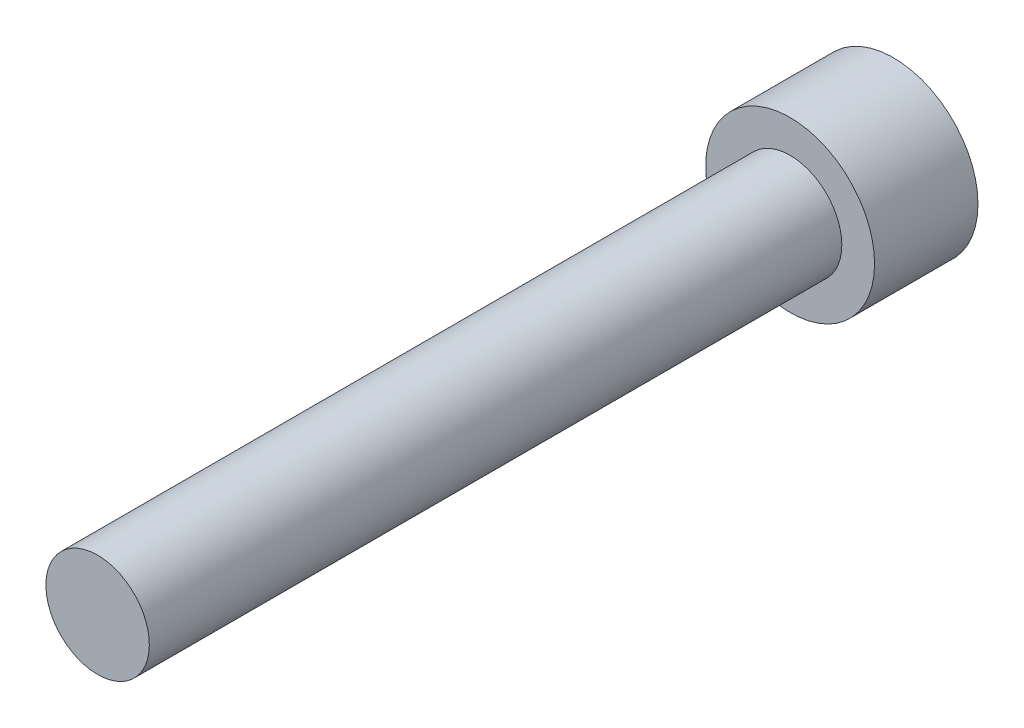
ISO-10303-21;
HEADER;
FILE_DESCRIPTION(('STEP AP214'),'2;1');
FILE_NAME('part.step','',(''),(''),'','','');
FILE_SCHEMA(('AUTOMOTIVE_DESIGN { 1 0 10303 214 1 1 1 1 }'));
ENDSEC;
DATA;
#1=APPLICATION_CONTEXT('core data for automotive mechanical design processes');
#2=APPLICATION_PROTOCOL_DEFINITION('international standard','automotive_design',2000,#1);
#3=PRODUCT_CONTEXT('',#1,'mechanical');
#4=PRODUCT('Part','Part','',(#3));
#5=PRODUCT_RELATED_PRODUCT_CATEGORY('part','',(#4));
#6=PRODUCT_DEFINITION_FORMATION('','',#4);
#7=PRODUCT_DEFINITION_CONTEXT('part definition',#1,'design');
#8=PRODUCT_DEFINITION('design','',#6,#7);
#9=PRODUCT_DEFINITION_SHAPE('','',#8);
#10=(LENGTH_UNIT() NAMED_UNIT(*) SI_UNIT(.MILLI.,.METRE.));
#11=(NAMED_UNIT(*) PLANE_ANGLE_UNIT() SI_UNIT($,.RADIAN.));
#12=(NAMED_UNIT(*) SI_UNIT($,.STERADIAN.) SOLID_ANGLE_UNIT());
#13=UNCERTAINTY_MEASURE_WITH_UNIT(LENGTH_MEASURE(1.E-05),#10,'distance_accuracy_value','');
#14=(GEOMETRIC_REPRESENTATION_CONTEXT(3) GLOBAL_UNCERTAINTY_ASSIGNED_CONTEXT((#13)) GLOBAL_UNIT_ASSIGNED_CONTEXT((#10,
#11,#12)) REPRESENTATION_CONTEXT('',''));
#15=CARTESIAN_POINT('',(0.,0.,0.));
#16=DIRECTION('',(0.,0.,1.));
#17=DIRECTION('',(1.,0.,0.));
#18=AXIS2_PLACEMENT_3D('',#15,#16,#17);
#19=CARTESIAN_POINT('',(0.,-2.3241,-2.8448));
#20=DIRECTION('',(0.,0.,-1.));
#21=DIRECTION('',(-1.,0.,0.));
#22=AXIS2_PLACEMENT_3D('',#19,#20,#21);
#23=PLANE('',#22);
#24=DIRECTION('',(0.866025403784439,-0.5,0.));
#25=VECTOR('',#24,1.);
#26=CARTESIAN_POINT('',(0.,1.36381680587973,-2.8448));
#27=LINE('',#26,#25);
#28=CARTESIAN_POINT('',(0.,1.36381680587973,-2.8448));
#29=VERTEX_POINT('',#28);
#30=CARTESIAN_POINT('',(1.1811,0.681908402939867,-2.8448));
#31=VERTEX_POINT('',#30);
#32=EDGE_CURVE('E51',#29,#31,#27,.T.);
#33=ORIENTED_EDGE('',*,*,#32,.F.);
#34=DIRECTION('',(0.866025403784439,0.5,0.));
#35=VECTOR('',#34,1.);
#36=CARTESIAN_POINT('',(-1.1811,0.681908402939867,-2.8448));
#37=LINE('',#36,#35);
#38=CARTESIAN_POINT('',(-1.1811,0.681908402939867,-2.8448));
#39=VERTEX_POINT('',#38);
#40=EDGE_CURVE('E134',#39,#29,#37,.T.);
#41=ORIENTED_EDGE('',*,*,#40,.F.);
#42=DIRECTION('',(0.,1.,0.));
#43=VECTOR('',#42,1.);
#44=CARTESIAN_POINT('',(-1.1811,-0.681908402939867,-2.8448));
#45=LINE('',#44,#43);
#46=CARTESIAN_POINT('',(-1.1811,-0.681908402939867,-2.8448));
#47=VERTEX_POINT('',#46);
#48=EDGE_CURVE('E132',#47,#39,#45,.T.);
#49=ORIENTED_EDGE('',*,*,#48,.F.);
#50=DIRECTION('',(-0.866025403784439,0.5,0.));
#51=VECTOR('',#50,1.);
#52=CARTESIAN_POINT('',(0.,-1.36381680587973,-2.8448));
#53=LINE('',#52,#51);
#54=CARTESIAN_POINT('',(0.,-1.36381680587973,-2.8448));
#55=VERTEX_POINT('',#54);
#56=EDGE_CURVE('E99',#55,#47,#53,.T.);
#57=ORIENTED_EDGE('',*,*,#56,.F.);
#58=DIRECTION('',(-0.866025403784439,-0.5,0.));
#59=VECTOR('',#58,1.);
#60=CARTESIAN_POINT('',(1.1811,-0.681908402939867,-2.8448));
#61=LINE('',#60,#59);
#62=CARTESIAN_POINT('',(1.1811,-0.681908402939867,-2.8448));
#63=VERTEX_POINT('',#62);
#64=EDGE_CURVE('E128',#63,#55,#61,.T.);
#65=ORIENTED_EDGE('',*,*,#64,.F.);
#66=DIRECTION('',(0.,-1.,0.));
#67=VECTOR('',#66,1.);
#68=CARTESIAN_POINT('',(1.1811,0.681908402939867,-2.8448));
#69=LINE('',#68,#67);
#70=EDGE_CURVE('E125',#31,#63,#69,.T.);
#71=ORIENTED_EDGE('',*,*,#70,.F.);
#72=EDGE_LOOP('',(#33,#41,#49,#57,#65,#71));
#73=FACE_BOUND('',#72,.T.);
#74=CARTESIAN_POINT('',(0.,0.,-2.8448));
#75=DIRECTION('',(0.,0.,1.));
#76=DIRECTION('',(1.,0.,0.));
#77=AXIS2_PLACEMENT_3D('',#74,#75,#76);
#78=CIRCLE('',#77,2.3241);
#79=CARTESIAN_POINT('',(2.3241,0.,-2.8448));
#80=VERTEX_POINT('',#79);
#81=EDGE_CURVE('E11',#80,#80,#78,.T.);
#82=ORIENTED_EDGE('',*,*,#81,.F.);
#83=EDGE_LOOP('',(#82));
#84=FACE_BOUND('',#83,.T.);
#85=ADVANCED_FACE('F37',(#73,#84),#23,.T.);
#86=CARTESIAN_POINT('',(0.,0.,19.05));
#87=DIRECTION('',(0.,0.,1.));
#88=DIRECTION('',(1.,0.,0.));
#89=AXIS2_PLACEMENT_3D('',#86,#87,#88);
#90=CYLINDRICAL_SURFACE('',#89,2.3241);
#91=ORIENTED_EDGE('',*,*,#81,.T.);
#92=EDGE_LOOP('',(#91));
#93=FACE_BOUND('',#92,.T.);
#94=CARTESIAN_POINT('',(0.,0.,0.));
#95=DIRECTION('',(0.,0.,1.));
#96=DIRECTION('',(1.,0.,0.));
#97=AXIS2_PLACEMENT_3D('',#94,#95,#96);
#98=CIRCLE('',#97,2.3241);
#99=CARTESIAN_POINT('',(2.3241,0.,0.));
#100=VERTEX_POINT('',#99);
#101=EDGE_CURVE('E44',#100,#100,#98,.T.);
#102=ORIENTED_EDGE('',*,*,#101,.F.);
#103=EDGE_LOOP('',(#102));
#104=FACE_BOUND('',#103,.T.);
#105=ADVANCED_FACE('F154',(#93,#104),#90,.T.);
#106=CARTESIAN_POINT('',(0.,-1.4224,0.));
#107=DIRECTION('',(0.,0.,1.));
#108=DIRECTION('',(1.,0.,0.));
#109=AXIS2_PLACEMENT_3D('',#106,#107,#108);
#110=PLANE('',#109);
#111=ORIENTED_EDGE('',*,*,#101,.T.);
#112=EDGE_LOOP('',(#111));
#113=FACE_BOUND('',#112,.T.);
#114=CARTESIAN_POINT('',(0.,0.,0.));
#115=DIRECTION('',(0.,0.,1.));
#116=DIRECTION('',(1.,0.,0.));
#117=AXIS2_PLACEMENT_3D('',#114,#115,#116);
#118=CIRCLE('',#117,1.4224);
#119=CARTESIAN_POINT('',(1.4224,0.,0.));
#120=VERTEX_POINT('',#119);
#121=EDGE_CURVE('E146',#120,#120,#118,.T.);
#122=ORIENTED_EDGE('',*,*,#121,.F.);
#123=EDGE_LOOP('',(#122));
#124=FACE_BOUND('',#123,.T.);
#125=ADVANCED_FACE('F151',(#113,#124),#110,.T.);
#126=CARTESIAN_POINT('',(0.,0.,19.05));
#127=DIRECTION('',(0.,0.,1.));
#128=DIRECTION('',(1.,0.,0.));
#129=AXIS2_PLACEMENT_3D('',#126,#127,#128);
#130=CYLINDRICAL_SURFACE('',#129,1.4224);
#131=ORIENTED_EDGE('',*,*,#121,.T.);
#132=EDGE_LOOP('',(#131));
#133=FACE_BOUND('',#132,.T.);
#134=CARTESIAN_POINT('',(0.,0.,19.05));
#135=DIRECTION('',(0.,0.,1.));
#136=DIRECTION('',(1.,0.,0.));
#137=AXIS2_PLACEMENT_3D('',#134,#135,#136);
#138=CIRCLE('',#137,1.4224);
#139=CARTESIAN_POINT('',(1.4224,0.,19.05));
#140=VERTEX_POINT('',#139);
#141=EDGE_CURVE('E138',#140,#140,#138,.T.);
#142=ORIENTED_EDGE('',*,*,#141,.F.);
#143=EDGE_LOOP('',(#142));
#144=FACE_BOUND('',#143,.T.);
#145=ADVANCED_FACE('F161',(#133,#144),#130,.T.);
#146=CARTESIAN_POINT('',(0.,0.,19.05));
#147=DIRECTION('',(0.,0.,1.));
#148=DIRECTION('',(1.,0.,0.));
#149=AXIS2_PLACEMENT_3D('',#146,#147,#148);
#150=PLANE('',#149);
#151=ORIENTED_EDGE('',*,*,#141,.T.);
#152=EDGE_LOOP('',(#151));
#153=FACE_BOUND('',#152,.T.);
#154=ADVANCED_FACE('F167',(#153),#150,.T.);
#155=CARTESIAN_POINT('',(0.,1.36381680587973,-1.0668));
#156=DIRECTION('',(0.5,0.866025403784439,0.));
#157=DIRECTION('',(-0.866025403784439,0.5,0.));
#158=AXIS2_PLACEMENT_3D('',#155,#156,#157);
#159=PLANE('',#158);
#160=ORIENTED_EDGE('',*,*,#32,.T.);
#161=DIRECTION('',(0.,0.,-1.));
#162=VECTOR('',#161,1.);
#163=CARTESIAN_POINT('',(1.1811,0.681908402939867,-1.0668));
#164=LINE('',#163,#162);
#165=CARTESIAN_POINT('',(1.1811,0.681908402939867,-1.0668));
#166=VERTEX_POINT('',#165);
#167=EDGE_CURVE('E81',#166,#31,#164,.T.);
#168=ORIENTED_EDGE('',*,*,#167,.F.);
#169=DIRECTION('',(0.866025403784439,-0.5,0.));
#170=VECTOR('',#169,1.);
#171=CARTESIAN_POINT('',(0.,1.36381680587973,-1.0668));
#172=LINE('',#171,#170);
#173=CARTESIAN_POINT('',(0.,1.36381680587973,-1.0668));
#174=VERTEX_POINT('',#173);
#175=EDGE_CURVE('E136',#174,#166,#172,.T.);
#176=ORIENTED_EDGE('',*,*,#175,.F.);
#177=DIRECTION('',(0.,0.,-1.));
#178=VECTOR('',#177,1.);
#179=CARTESIAN_POINT('',(0.,1.36381680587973,-1.0668));
#180=LINE('',#179,#178);
#181=EDGE_CURVE('E59',#174,#29,#180,.T.);
#182=ORIENTED_EDGE('',*,*,#181,.T.);
#183=EDGE_LOOP('',(#160,#168,#176,#182));
#184=FACE_BOUND('',#183,.T.);
#185=ADVANCED_FACE('F171',(#184),#159,.F.);
#186=CARTESIAN_POINT('',(-1.1811,0.681908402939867,-1.0668));
#187=DIRECTION('',(-0.5,0.866025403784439,0.));
#188=DIRECTION('',(-0.866025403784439,-0.5,0.));
#189=AXIS2_PLACEMENT_3D('',#186,#187,#188);
#190=PLANE('',#189);
#191=ORIENTED_EDGE('',*,*,#40,.T.);
#192=ORIENTED_EDGE('',*,*,#181,.F.);
#193=DIRECTION('',(0.866025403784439,0.5,0.));
#194=VECTOR('',#193,1.);
#195=CARTESIAN_POINT('',(-1.1811,0.681908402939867,-1.0668));
#196=LINE('',#195,#194);
#197=CARTESIAN_POINT('',(-1.1811,0.681908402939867,-1.0668));
#198=VERTEX_POINT('',#197);
#199=EDGE_CURVE('E111',#198,#174,#196,.T.);
#200=ORIENTED_EDGE('',*,*,#199,.F.);
#201=DIRECTION('',(0.,0.,-1.));
#202=VECTOR('',#201,1.);
#203=CARTESIAN_POINT('',(-1.1811,0.681908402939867,-1.0668));
#204=LINE('',#203,#202);
#205=EDGE_CURVE('E103',#198,#39,#204,.T.);
#206=ORIENTED_EDGE('',*,*,#205,.T.);
#207=EDGE_LOOP('',(#191,#192,#200,#206));
#208=FACE_BOUND('',#207,.T.);
#209=ADVANCED_FACE('F175',(#208),#190,.F.);
#210=CARTESIAN_POINT('',(-1.1811,-0.681908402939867,-1.0668));
#211=DIRECTION('',(-1.,0.,0.));
#212=DIRECTION('',(0.,-1.,0.));
#213=AXIS2_PLACEMENT_3D('',#210,#211,#212);
#214=PLANE('',#213);
#215=ORIENTED_EDGE('',*,*,#48,.T.);
#216=ORIENTED_EDGE('',*,*,#205,.F.);
#217=DIRECTION('',(0.,1.,0.));
#218=VECTOR('',#217,1.);
#219=CARTESIAN_POINT('',(-1.1811,-0.681908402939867,-1.0668));
#220=LINE('',#219,#218);
#221=CARTESIAN_POINT('',(-1.1811,-0.681908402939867,-1.0668));
#222=VERTEX_POINT('',#221);
#223=EDGE_CURVE('E107',#222,#198,#220,.T.);
#224=ORIENTED_EDGE('',*,*,#223,.F.);
#225=DIRECTION('',(0.,0.,-1.));
#226=VECTOR('',#225,1.);
#227=CARTESIAN_POINT('',(-1.1811,-0.681908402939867,-1.0668));
#228=LINE('',#227,#226);
#229=EDGE_CURVE('E92',#222,#47,#228,.T.);
#230=ORIENTED_EDGE('',*,*,#229,.T.);
#231=EDGE_LOOP('',(#215,#216,#224,#230));
#232=FACE_BOUND('',#231,.T.);
#233=ADVANCED_FACE('F108',(#232),#214,.F.);
#234=CARTESIAN_POINT('',(0.,-1.36381680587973,-1.0668));
#235=DIRECTION('',(-0.5,-0.866025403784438,0.));
#236=DIRECTION('',(0.866025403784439,-0.5,0.));
#237=AXIS2_PLACEMENT_3D('',#234,#235,#236);
#238=PLANE('',#237);
#239=ORIENTED_EDGE('',*,*,#56,.T.);
#240=ORIENTED_EDGE('',*,*,#229,.F.);
#241=DIRECTION('',(-0.866025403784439,0.5,0.));
#242=VECTOR('',#241,1.);
#243=CARTESIAN_POINT('',(0.,-1.36381680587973,-1.0668));
#244=LINE('',#243,#242);
#245=CARTESIAN_POINT('',(0.,-1.36381680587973,-1.0668));
#246=VERTEX_POINT('',#245);
#247=EDGE_CURVE('E96',#246,#222,#244,.T.);
#248=ORIENTED_EDGE('',*,*,#247,.F.);
#249=DIRECTION('',(0.,0.,-1.));
#250=VECTOR('',#249,1.);
#251=CARTESIAN_POINT('',(0.,-1.36381680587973,-1.0668));
#252=LINE('',#251,#250);
#253=EDGE_CURVE('E104',#246,#55,#252,.T.);
#254=ORIENTED_EDGE('',*,*,#253,.T.);
#255=EDGE_LOOP('',(#239,#240,#248,#254));
#256=FACE_BOUND('',#255,.T.);
#257=ADVANCED_FACE('F94',(#256),#238,.F.);
#258=CARTESIAN_POINT('',(1.1811,-0.681908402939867,-1.0668));
#259=DIRECTION('',(0.5,-0.866025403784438,0.));
#260=DIRECTION('',(0.866025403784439,0.5,0.));
#261=AXIS2_PLACEMENT_3D('',#258,#259,#260);
#262=PLANE('',#261);
#263=ORIENTED_EDGE('',*,*,#64,.T.);
#264=ORIENTED_EDGE('',*,*,#253,.F.);
#265=DIRECTION('',(-0.866025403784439,-0.5,0.));
#266=VECTOR('',#265,1.);
#267=CARTESIAN_POINT('',(1.1811,-0.681908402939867,-1.0668));
#268=LINE('',#267,#266);
#269=CARTESIAN_POINT('',(1.1811,-0.681908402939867,-1.0668));
#270=VERTEX_POINT('',#269);
#271=EDGE_CURVE('E117',#270,#246,#268,.T.);
#272=ORIENTED_EDGE('',*,*,#271,.F.);
#273=DIRECTION('',(0.,0.,-1.));
#274=VECTOR('',#273,1.);
#275=CARTESIAN_POINT('',(1.1811,-0.681908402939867,-1.0668));
#276=LINE('',#275,#274);
#277=EDGE_CURVE('E141',#270,#63,#276,.T.);
#278=ORIENTED_EDGE('',*,*,#277,.T.);
#279=EDGE_LOOP('',(#263,#264,#272,#278));
#280=FACE_BOUND('',#279,.T.);
#281=ADVANCED_FACE('F179',(#280),#262,.F.);
#282=CARTESIAN_POINT('',(1.1811,0.681908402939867,-1.0668));
#283=DIRECTION('',(1.,0.,0.));
#284=DIRECTION('',(0.,0.,-1.));
#285=AXIS2_PLACEMENT_3D('',#282,#283,#284);
#286=PLANE('',#285);
#287=ORIENTED_EDGE('',*,*,#70,.T.);
#288=ORIENTED_EDGE('',*,*,#277,.F.);
#289=DIRECTION('',(0.,-1.,0.));
#290=VECTOR('',#289,1.);
#291=CARTESIAN_POINT('',(1.1811,0.681908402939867,-1.0668));
#292=LINE('',#291,#290);
#293=EDGE_CURVE('E119',#166,#270,#292,.T.);
#294=ORIENTED_EDGE('',*,*,#293,.F.);
#295=ORIENTED_EDGE('',*,*,#167,.T.);
#296=EDGE_LOOP('',(#287,#288,#294,#295));
#297=FACE_BOUND('',#296,.T.);
#298=ADVANCED_FACE('F176',(#297),#286,.F.);
#299=CARTESIAN_POINT('',(1.1811,0.681908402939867,-1.0668));
#300=DIRECTION('',(0.,0.,-1.));
#301=DIRECTION('',(-1.,0.,0.));
#302=AXIS2_PLACEMENT_3D('',#299,#300,#301);
#303=PLANE('',#302);
#304=ORIENTED_EDGE('',*,*,#175,.T.);
#305=ORIENTED_EDGE('',*,*,#293,.T.);
#306=ORIENTED_EDGE('',*,*,#271,.T.);
#307=ORIENTED_EDGE('',*,*,#247,.T.);
#308=ORIENTED_EDGE('',*,*,#223,.T.);
#309=ORIENTED_EDGE('',*,*,#199,.T.);
#310=EDGE_LOOP('',(#304,#305,#306,#307,#308,#309));
#311=FACE_BOUND('',#310,.T.);
#312=ADVANCED_FACE('F114',(#311),#303,.T.);
#313=CLOSED_SHELL('',(#85,#105,#125,#145,#154,#185,#209,#233,#257,#281,#298,#312));
#314=MANIFOLD_SOLID_BREP('B2',#313);
#315=ADVANCED_BREP_SHAPE_REPRESENTATION('',(#18,#314),#14);
#316=SHAPE_DEFINITION_REPRESENTATION(#9,#315);
ENDSEC;
END-ISO-10303-21;
